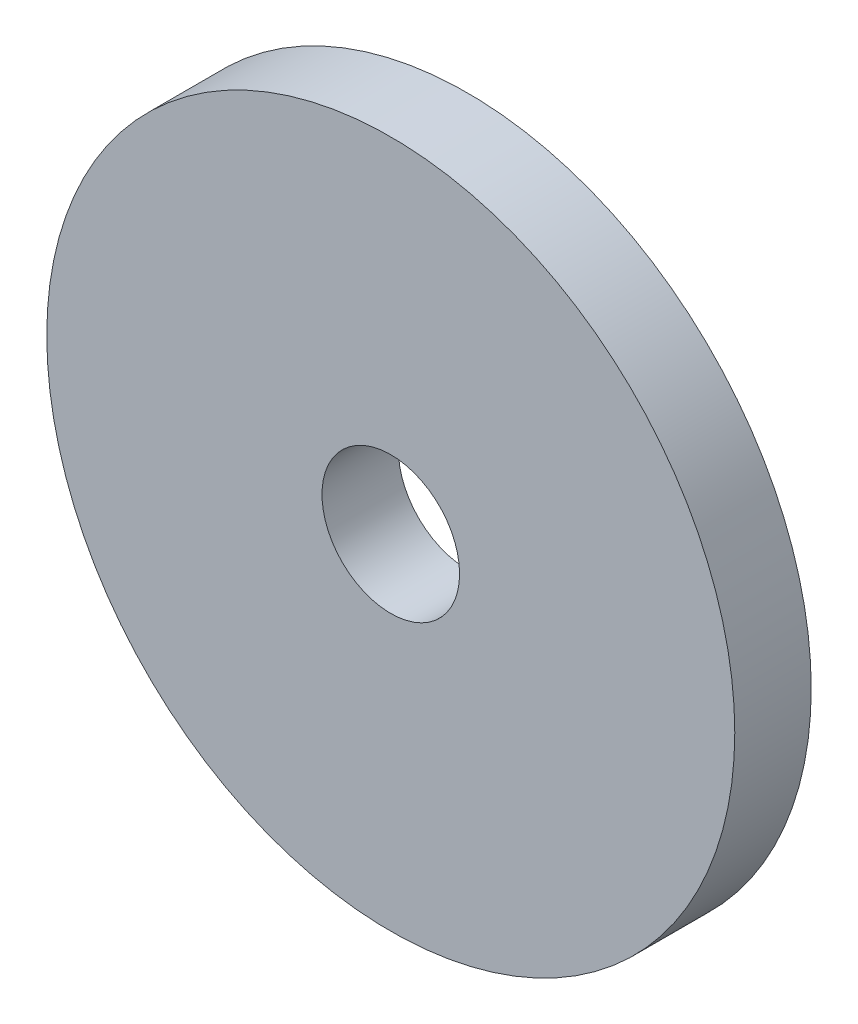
from build123d import *

# Parameters (mm, degrees)
ESQUISSE1_R          = 45
ESQUISSE1_R_2        = 9
BASE_EXTRUSION_DEPTH = 10


with BuildPart() as part:
    # Esquisse1 → Base-Extrusion (new body)
    with BuildSketch(Plane.XY):
        Circle(ESQUISSE1_R)
        Circle(ESQUISSE1_R_2, mode=Mode.SUBTRACT)
    extrude(amount=BASE_EXTRUSION_DEPTH)


solid = part.part
